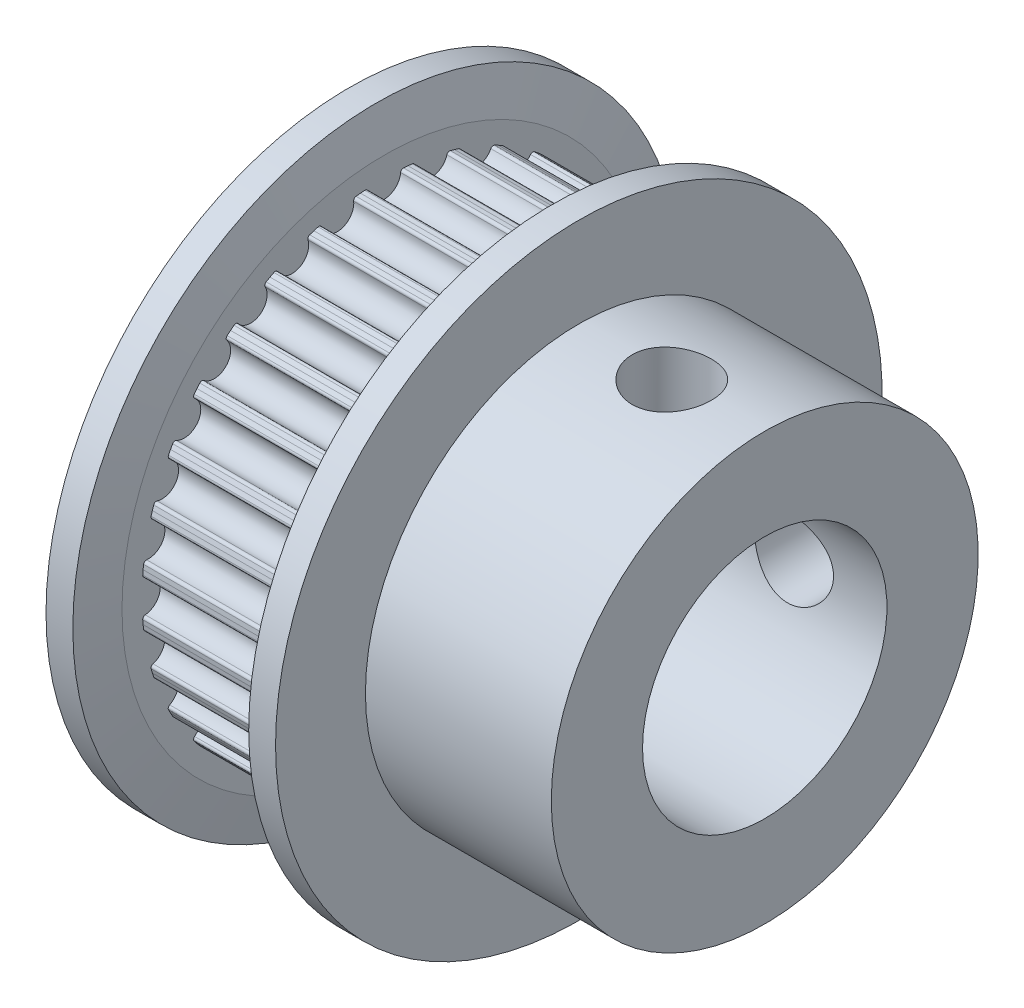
from build123d import *

# Parameters (mm, degrees)
CUT_EXTRUDE1_DEPTH = 6.55
CIRPATTERN1_COUNT  = 32
SKETCH39_R         = 5.01
CUT_EXTRUDE2_DEPTH = 17.03
SKETCH37_W         = 1.621
SKETCH37_H         = 9.93
CIRPATTERN2_COUNT  = 2
CIRPATTERN2_ANGLE  = 90


with BuildPart() as part:
    # Sketch1 → Revolve1 (revolve)
    with BuildSketch(Plane.XY, mode=Mode.PRIVATE) as revolve1_sk:
        Polygon((0, 0), (0, 8.75), (1.43, 8.75), (1.43, 10.088071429), (7.98, 10.088071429), (7.98, 8.75), (17.03, 8.75), (17.03, 0), align=None)
    revolve(revolve1_sk.sketch.rotate(Axis((17.03, 0, 0), (-1, 0, 0)), 270), axis=Axis((17.03, 0, 0), (-1, 0, 0)))

    # Sketch2 → Cut-Extrude1 (cut)
    with BuildSketch(Plane(origin=(1.43, 0, 0), x_dir=(0, 0, -1), z_dir=(1, 0, 0))):
        with BuildLine():
            Line((-1.03437385, 9.879953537), (-1.057813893, 10.129918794))
            ThreePointArc((-1.057813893, 10.129918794), (0, 10.185), (1.057813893, 10.129918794))
            Line((1.057813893, 10.129918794), (1.03437385, 9.879953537))
            Line((1.03437385, 9.879953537), (0.792969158, 9.89929093))
            ThreePointArc((0.792969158, 9.89929093), (0.711706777, 9.87316989), (0.672449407, 9.797375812))
            ThreePointArc((0.672449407, 9.797375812), (0, 9.181), (-0.672449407, 9.797375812))
            ThreePointArc((-0.672449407, 9.797375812), (-0.711706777, 9.87316989), (-0.792969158, 9.89929093))
            Line((-0.792969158, 9.89929093), (-1.03437385, 9.879953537))
        make_face()
    cut_extrude1 = extrude(amount=CUT_EXTRUDE1_DEPTH, mode=Mode.SUBTRACT)

    # CirPattern1: Cut-Extrude1 ×32 about axis
    cirpattern1_axis = Axis((0, 0, 0), (1, 0, 0))
    for i in range(1, CIRPATTERN1_COUNT):
        add(cut_extrude1.rotate(cirpattern1_axis, i * 360 / CIRPATTERN1_COUNT), mode=Mode.SUBTRACT)

    # Sketch34 → Revolve2 (revolve)
    with BuildSketch(Plane.XY, mode=Mode.PRIVATE) as revolve2_sk:
        Polygon((7.98, 8.75), (7.98, 10.75), (8.31, 12.435), (9.41, 12.435), (9.41, 8.75), align=None)
        Polygon((1.43, 8.75), (1.43, 10.75), (1.1, 12.435), (0, 12.435), (0, 8.76), (0.01, 8.75), align=None)
    revolve(revolve2_sk.sketch.rotate(Axis((17.03, 0, 0), (-1, 0, 0)), 270), axis=Axis((17.03, 0, 0), (-1, 0, 0)))

    # Sketch39 → Cut-Extrude2 (cut)
    with BuildSketch(Plane.ZY):
        Circle(SKETCH39_R)
    extrude(amount=-CUT_EXTRUDE2_DEPTH, mode=Mode.SUBTRACT)

    # Sketch37 → Cut-Revolve2 (revolve, cut)
    with BuildSketch(Plane(origin=(13.22, 0, 0), x_dir=(0, 0, -1), z_dir=(1, 0, 0)), mode=Mode.PRIVATE) as cut_revolve2_sk:
        with Locations((0.8105, 4.965)):
            Rectangle(SKETCH37_W, SKETCH37_H)
    cut_revolve2 = revolve(cut_revolve2_sk.sketch.rotate(Axis((13.22, 0, 0), (0, 1, 0)), 180), axis=Axis((13.22, 0, 0), (0, 1, 0)), mode=Mode.SUBTRACT)

    # CirPattern2: Cut-Revolve2 ×2 about axis
    cirpattern2_axis = Axis((17.03, 0, 0), (-1, 0, 0))
    for i in range(1, CIRPATTERN2_COUNT):
        add(cut_revolve2.rotate(cirpattern2_axis, i * CIRPATTERN2_ANGLE / (CIRPATTERN2_COUNT - 1)), mode=Mode.SUBTRACT)


solid = part.part
